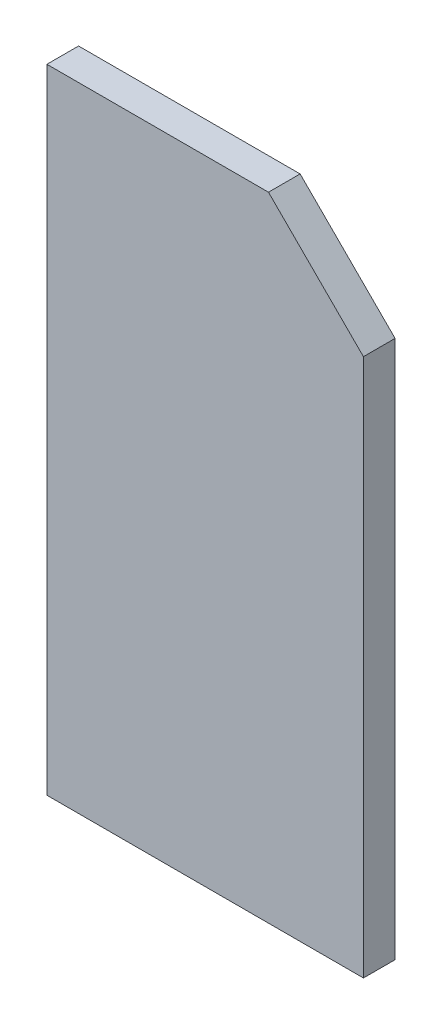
ISO-10303-21;
HEADER;
FILE_DESCRIPTION(('STEP AP214'),'2;1');
FILE_NAME('part.step','',(''),(''),'','','');
FILE_SCHEMA(('AUTOMOTIVE_DESIGN { 1 0 10303 214 1 1 1 1 }'));
ENDSEC;
DATA;
#1=APPLICATION_CONTEXT('core data for automotive mechanical design processes');
#2=APPLICATION_PROTOCOL_DEFINITION('international standard','automotive_design',2000,#1);
#3=PRODUCT_CONTEXT('',#1,'mechanical');
#4=PRODUCT('Part','Part','',(#3));
#5=PRODUCT_RELATED_PRODUCT_CATEGORY('part','',(#4));
#6=PRODUCT_DEFINITION_FORMATION('','',#4);
#7=PRODUCT_DEFINITION_CONTEXT('part definition',#1,'design');
#8=PRODUCT_DEFINITION('design','',#6,#7);
#9=PRODUCT_DEFINITION_SHAPE('','',#8);
#10=(LENGTH_UNIT() NAMED_UNIT(*) SI_UNIT(.MILLI.,.METRE.));
#11=(NAMED_UNIT(*) PLANE_ANGLE_UNIT() SI_UNIT($,.RADIAN.));
#12=(NAMED_UNIT(*) SI_UNIT($,.STERADIAN.) SOLID_ANGLE_UNIT());
#13=UNCERTAINTY_MEASURE_WITH_UNIT(LENGTH_MEASURE(1.E-05),#10,'distance_accuracy_value','');
#14=(GEOMETRIC_REPRESENTATION_CONTEXT(3) GLOBAL_UNCERTAINTY_ASSIGNED_CONTEXT((#13)) GLOBAL_UNIT_ASSIGNED_CONTEXT((#10,
#11,#12)) REPRESENTATION_CONTEXT('',''));
#15=CARTESIAN_POINT('',(0.,0.,0.));
#16=DIRECTION('',(0.,0.,1.));
#17=DIRECTION('',(1.,0.,0.));
#18=AXIS2_PLACEMENT_3D('',#15,#16,#17);
#19=CARTESIAN_POINT('',(0.,0.,25.));
#20=DIRECTION('',(1.,0.,0.));
#21=DIRECTION('',(0.,0.,-1.));
#22=AXIS2_PLACEMENT_3D('',#19,#20,#21);
#23=PLANE('',#22);
#24=DIRECTION('',(0.,-1.,0.));
#25=VECTOR('',#24,1.);
#26=CARTESIAN_POINT('',(0.,0.,0.));
#27=LINE('',#26,#25);
#28=CARTESIAN_POINT('',(0.,500.,0.));
#29=VERTEX_POINT('',#28);
#30=CARTESIAN_POINT('',(0.,0.,0.));
#31=VERTEX_POINT('',#30);
#32=EDGE_CURVE('E116',#29,#31,#27,.T.);
#33=ORIENTED_EDGE('',*,*,#32,.T.);
#34=DIRECTION('',(0.,0.,-1.));
#35=VECTOR('',#34,1.);
#36=CARTESIAN_POINT('',(0.,0.,25.));
#37=LINE('',#36,#35);
#38=CARTESIAN_POINT('',(0.,0.,25.));
#39=VERTEX_POINT('',#38);
#40=EDGE_CURVE('E47',#39,#31,#37,.T.);
#41=ORIENTED_EDGE('',*,*,#40,.F.);
#42=DIRECTION('',(0.,-1.,0.));
#43=VECTOR('',#42,1.);
#44=CARTESIAN_POINT('',(0.,0.,25.));
#45=LINE('',#44,#43);
#46=CARTESIAN_POINT('',(0.,500.,25.));
#47=VERTEX_POINT('',#46);
#48=EDGE_CURVE('E128',#47,#39,#45,.T.);
#49=ORIENTED_EDGE('',*,*,#48,.F.);
#50=DIRECTION('',(0.,0.,-1.));
#51=VECTOR('',#50,1.);
#52=CARTESIAN_POINT('',(0.,500.,25.));
#53=LINE('',#52,#51);
#54=EDGE_CURVE('E105',#47,#29,#53,.T.);
#55=ORIENTED_EDGE('',*,*,#54,.T.);
#56=EDGE_LOOP('',(#33,#41,#49,#55));
#57=FACE_BOUND('',#56,.T.);
#58=ADVANCED_FACE('F39',(#57),#23,.F.);
#59=CARTESIAN_POINT('',(0.,0.,25.));
#60=DIRECTION('',(0.,1.,0.));
#61=DIRECTION('',(0.,0.,1.));
#62=AXIS2_PLACEMENT_3D('',#59,#60,#61);
#63=PLANE('',#62);
#64=DIRECTION('',(1.,0.,0.));
#65=VECTOR('',#64,1.);
#66=CARTESIAN_POINT('',(0.,0.,0.));
#67=LINE('',#66,#65);
#68=CARTESIAN_POINT('',(250.,0.,0.));
#69=VERTEX_POINT('',#68);
#70=EDGE_CURVE('E120',#31,#69,#67,.T.);
#71=ORIENTED_EDGE('',*,*,#70,.T.);
#72=DIRECTION('',(0.,0.,-1.));
#73=VECTOR('',#72,1.);
#74=CARTESIAN_POINT('',(250.,0.,25.));
#75=LINE('',#74,#73);
#76=CARTESIAN_POINT('',(250.,0.,25.));
#77=VERTEX_POINT('',#76);
#78=EDGE_CURVE('E111',#77,#69,#75,.T.);
#79=ORIENTED_EDGE('',*,*,#78,.F.);
#80=DIRECTION('',(1.,0.,0.));
#81=VECTOR('',#80,1.);
#82=CARTESIAN_POINT('',(0.,0.,25.));
#83=LINE('',#82,#81);
#84=EDGE_CURVE('E86',#39,#77,#83,.T.);
#85=ORIENTED_EDGE('',*,*,#84,.F.);
#86=ORIENTED_EDGE('',*,*,#40,.T.);
#87=EDGE_LOOP('',(#71,#79,#85,#86));
#88=FACE_BOUND('',#87,.T.);
#89=ADVANCED_FACE('F134',(#88),#63,.F.);
#90=CARTESIAN_POINT('',(250.,500.,25.));
#91=DIRECTION('',(-1.,0.,0.));
#92=DIRECTION('',(0.,-1.,0.));
#93=AXIS2_PLACEMENT_3D('',#90,#91,#92);
#94=PLANE('',#93);
#95=DIRECTION('',(0.,1.,0.));
#96=VECTOR('',#95,1.);
#97=CARTESIAN_POINT('',(250.,500.,0.));
#98=LINE('',#97,#96);
#99=CARTESIAN_POINT('',(250.,425.,0.));
#100=VERTEX_POINT('',#99);
#101=EDGE_CURVE('E123',#69,#100,#98,.T.);
#102=ORIENTED_EDGE('',*,*,#101,.T.);
#103=DIRECTION('',(0.,0.,1.));
#104=VECTOR('',#103,1.);
#105=CARTESIAN_POINT('',(250.,425.,-0.399999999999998));
#106=LINE('',#105,#104);
#107=CARTESIAN_POINT('',(250.,425.,25.));
#108=VERTEX_POINT('',#107);
#109=EDGE_CURVE('E53',#100,#108,#106,.T.);
#110=ORIENTED_EDGE('',*,*,#109,.T.);
#111=DIRECTION('',(0.,1.,0.));
#112=VECTOR('',#111,1.);
#113=CARTESIAN_POINT('',(250.,500.,25.));
#114=LINE('',#113,#112);
#115=EDGE_CURVE('E101',#77,#108,#114,.T.);
#116=ORIENTED_EDGE('',*,*,#115,.F.);
#117=ORIENTED_EDGE('',*,*,#78,.T.);
#118=EDGE_LOOP('',(#102,#110,#116,#117));
#119=FACE_BOUND('',#118,.T.);
#120=ADVANCED_FACE('F141',(#119),#94,.F.);
#121=CARTESIAN_POINT('',(0.,500.,25.));
#122=DIRECTION('',(0.,-1.,0.));
#123=DIRECTION('',(1.,0.,0.));
#124=AXIS2_PLACEMENT_3D('',#121,#122,#123);
#125=PLANE('',#124);
#126=DIRECTION('',(-1.,0.,0.));
#127=VECTOR('',#126,1.);
#128=CARTESIAN_POINT('',(0.,500.,25.));
#129=LINE('',#128,#127);
#130=CARTESIAN_POINT('',(175.,500.,25.));
#131=VERTEX_POINT('',#130);
#132=EDGE_CURVE('E62',#131,#47,#129,.T.);
#133=ORIENTED_EDGE('',*,*,#132,.F.);
#134=DIRECTION('',(0.,0.,1.));
#135=VECTOR('',#134,1.);
#136=CARTESIAN_POINT('',(175.,500.,-0.399999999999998));
#137=LINE('',#136,#135);
#138=CARTESIAN_POINT('',(175.,500.,0.));
#139=VERTEX_POINT('',#138);
#140=EDGE_CURVE('E93',#139,#131,#137,.T.);
#141=ORIENTED_EDGE('',*,*,#140,.F.);
#142=DIRECTION('',(-1.,0.,0.));
#143=VECTOR('',#142,1.);
#144=CARTESIAN_POINT('',(0.,500.,0.));
#145=LINE('',#144,#143);
#146=EDGE_CURVE('E80',#139,#29,#145,.T.);
#147=ORIENTED_EDGE('',*,*,#146,.T.);
#148=ORIENTED_EDGE('',*,*,#54,.F.);
#149=EDGE_LOOP('',(#133,#141,#147,#148));
#150=FACE_BOUND('',#149,.T.);
#151=ADVANCED_FACE('F104',(#150),#125,.F.);
#152=CARTESIAN_POINT('',(0.,0.,25.));
#153=DIRECTION('',(0.,0.,-1.));
#154=DIRECTION('',(-1.,0.,0.));
#155=AXIS2_PLACEMENT_3D('',#152,#153,#154);
#156=PLANE('',#155);
#157=ORIENTED_EDGE('',*,*,#115,.T.);
#158=DIRECTION('',(0.707106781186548,-0.707106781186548,0.));
#159=VECTOR('',#158,1.);
#160=CARTESIAN_POINT('',(175.,500.,25.));
#161=LINE('',#160,#159);
#162=EDGE_CURVE('E95',#131,#108,#161,.T.);
#163=ORIENTED_EDGE('',*,*,#162,.F.);
#164=ORIENTED_EDGE('',*,*,#132,.T.);
#165=ORIENTED_EDGE('',*,*,#48,.T.);
#166=ORIENTED_EDGE('',*,*,#84,.T.);
#167=EDGE_LOOP('',(#157,#163,#164,#165,#166));
#168=FACE_BOUND('',#167,.T.);
#169=ADVANCED_FACE('F99',(#168),#156,.F.);
#170=CARTESIAN_POINT('',(0.,0.,0.));
#171=DIRECTION('',(0.,0.,-1.));
#172=DIRECTION('',(-1.,0.,0.));
#173=AXIS2_PLACEMENT_3D('',#170,#171,#172);
#174=PLANE('',#173);
#175=DIRECTION('',(-0.707106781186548,0.707106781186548,0.));
#176=VECTOR('',#175,1.);
#177=CARTESIAN_POINT('',(337.5,337.5,0.));
#178=LINE('',#177,#176);
#179=EDGE_CURVE('E11',#100,#139,#178,.T.);
#180=ORIENTED_EDGE('',*,*,#179,.F.);
#181=ORIENTED_EDGE('',*,*,#101,.F.);
#182=ORIENTED_EDGE('',*,*,#70,.F.);
#183=ORIENTED_EDGE('',*,*,#32,.F.);
#184=ORIENTED_EDGE('',*,*,#146,.F.);
#185=EDGE_LOOP('',(#180,#181,#182,#183,#184));
#186=FACE_BOUND('',#185,.T.);
#187=ADVANCED_FACE('F138',(#186),#174,.T.);
#188=CARTESIAN_POINT('',(175.,500.,-0.399999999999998));
#189=DIRECTION('',(-0.707106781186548,-0.707106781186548,0.));
#190=DIRECTION('',(0.707106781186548,-0.707106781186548,0.));
#191=AXIS2_PLACEMENT_3D('',#188,#189,#190);
#192=PLANE('',#191);
#193=ORIENTED_EDGE('',*,*,#179,.T.);
#194=ORIENTED_EDGE('',*,*,#140,.T.);
#195=ORIENTED_EDGE('',*,*,#162,.T.);
#196=ORIENTED_EDGE('',*,*,#109,.F.);
#197=EDGE_LOOP('',(#193,#194,#195,#196));
#198=FACE_BOUND('',#197,.T.);
#199=ADVANCED_FACE('F94',(#198),#192,.F.);
#200=CLOSED_SHELL('',(#58,#89,#120,#151,#169,#187,#199));
#201=MANIFOLD_SOLID_BREP('B2',#200);
#202=ADVANCED_BREP_SHAPE_REPRESENTATION('',(#18,#201),#14);
#203=SHAPE_DEFINITION_REPRESENTATION(#9,#202);
ENDSEC;
END-ISO-10303-21;
